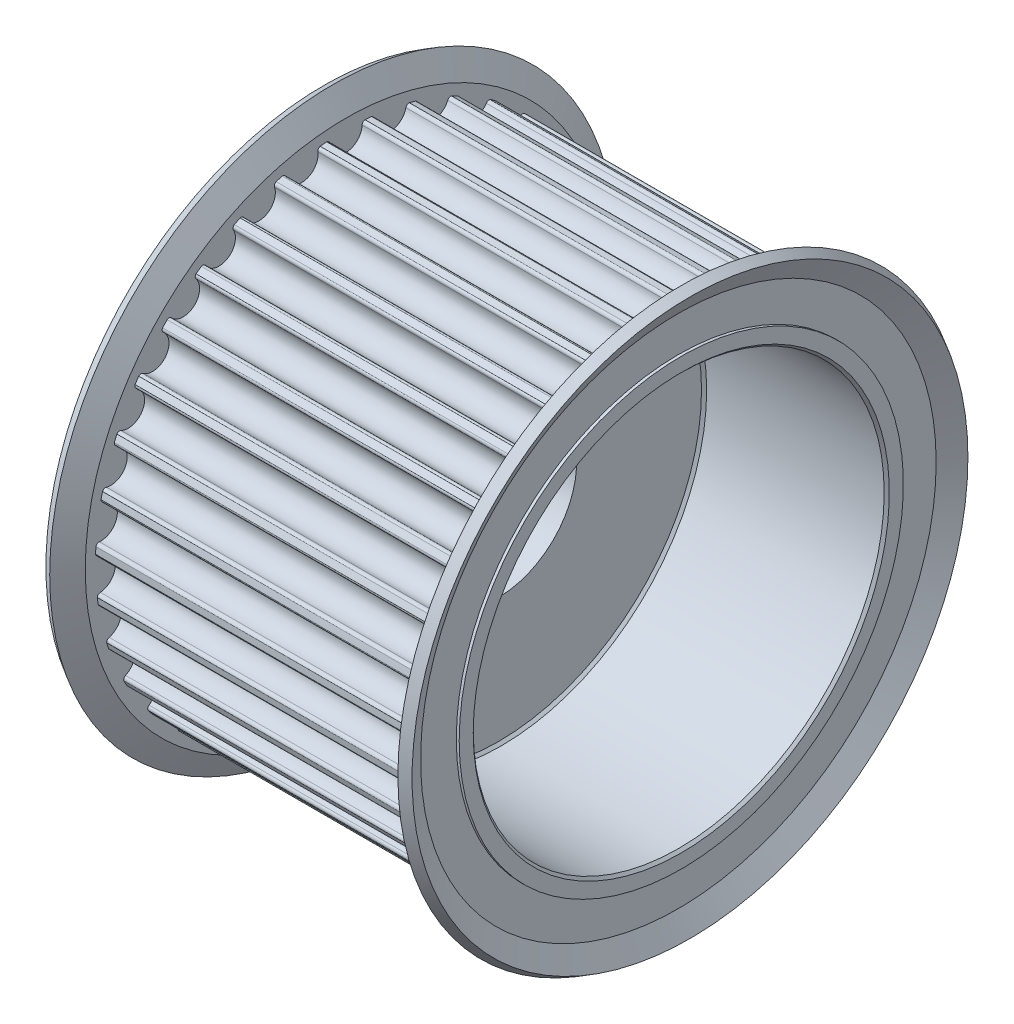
from build123d import *

# Parameters (mm, degrees)
CUT_EXTRUDE1_DEPTH = 150.20217095
CIRCPATTERN1_COUNT = 35
CHAMFER1_SIZE      = 0.7874


with BuildPart() as part:
    # Sketch1 → Revolve1 (revolve)
    with BuildSketch(Plane.XY, mode=Mode.PRIVATE) as revolve1_sk:
        Polygon((50.8, 23.876), (0, 23.876), (0, 67.93865), (4.064, 67.93865), (4.064, 76.58735), (102.616, 76.58735), (102.616, 67.93865), (106.68, 67.93865), (106.68, 62.85865), (50.8, 62.85865), align=None)
    revolve(revolve1_sk.sketch.rotate(Axis((0, 0, 0), (1, 0, 0)), 90), axis=Axis((0, 0, 0), (1, 0, 0)))

    # Sketch2 → Cut-Extrude1 (cut, through all)
    with BuildSketch(Plane(origin=(102.616, 0, 0), x_dir=(0, 0, -1), z_dir=(1, 0, 0))):
        with BuildLine():
            ThreePointArc((-4.996624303, 75.407040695), (0, 70.590740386), (4.996624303, 75.407040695))
            ThreePointArc((4.996624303, 75.407040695), (5.257455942, 76.044561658), (5.868677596, 76.362168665))
            ThreePointArc((5.868677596, 76.362168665), (0, 81.509902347), (-5.868677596, 76.362168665))
            ThreePointArc((-5.868677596, 76.362168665), (-5.257455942, 76.044561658), (-4.996624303, 75.407040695))
        make_face()
    cut_extrude1 = extrude(amount=-CUT_EXTRUDE1_DEPTH, mode=Mode.SUBTRACT)

    # CircPattern1: Cut-Extrude1 ×35 about axis
    circpattern1_axis = Axis((0, 0, 0), (1, 0, 0))
    for i in range(1, CIRCPATTERN1_COUNT):
        add(cut_extrude1.rotate(circpattern1_axis, i * 360 / CIRCPATTERN1_COUNT), mode=Mode.SUBTRACT)

    # Chamfer1
    chamfer1_edges = [part.edges().sort_by_distance(p)[0] for p in [
        (106.68, 0, -62.85865),
        (50.8, 0, -62.85865),
    ]]
    chamfer(chamfer1_edges, length=CHAMFER1_SIZE)

    # Sketch4 → Revolve2 (revolve)
    with BuildSketch(Plane.XY, mode=Mode.PRIVATE) as revolve2_sk:
        Polygon((102.616, 67.93865), (102.616, 79.711388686), (106.597558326, 86.60765), (109.347188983, 85.02015), (105.791, 78.86065), (105.791, 67.93865), align=None)
        Polygon((0.889, 67.93865), (4.064, 67.93865), (4.064, 79.711388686), (0.082441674, 86.60765), (-2.667188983, 85.02015), (0.889, 78.86065), align=None)
    revolve(revolve2_sk.sketch.rotate(Axis((0, 0, 0), (-1, 0, 0)), 90), axis=Axis((0, 0, 0), (-1, 0, 0)))


solid = part.part
